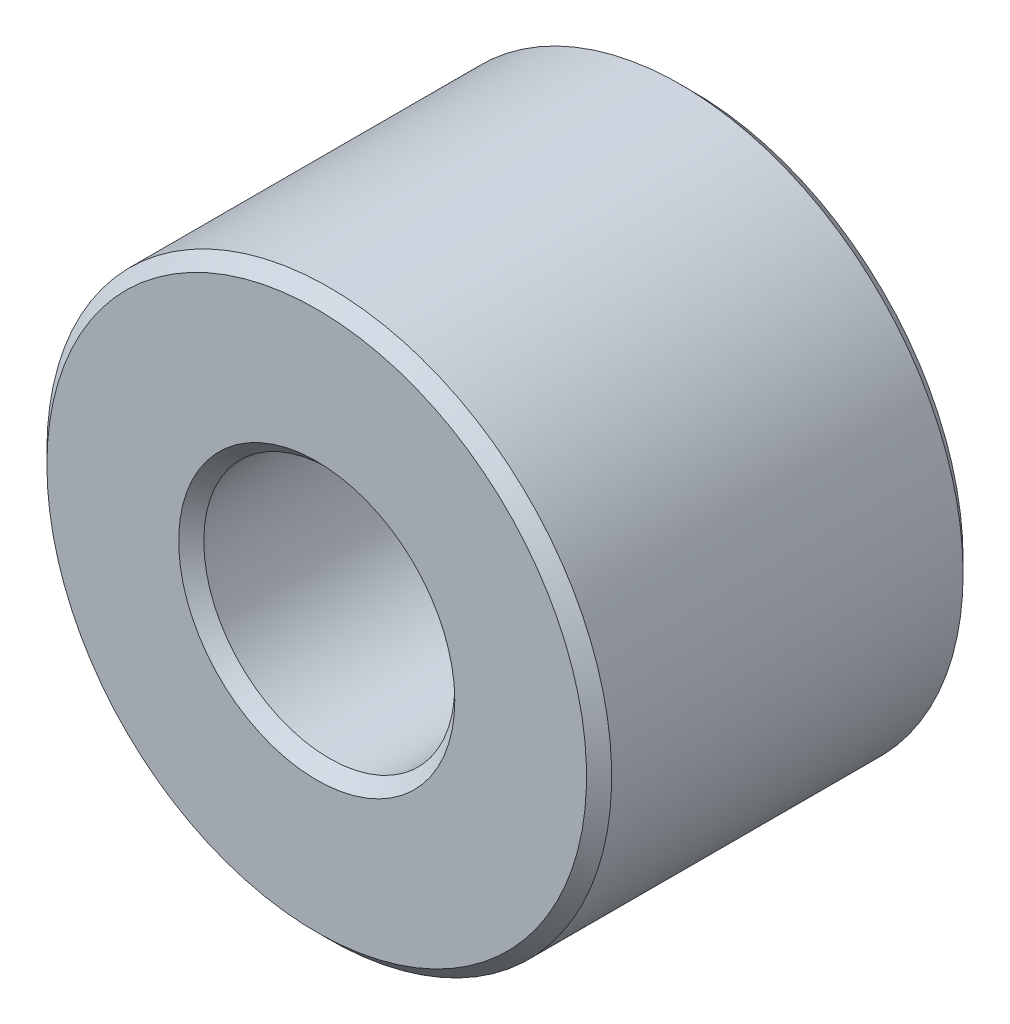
ISO-10303-21;
HEADER;
FILE_DESCRIPTION(('STEP AP214'),'2;1');
FILE_NAME('part.step','',(''),(''),'','','');
FILE_SCHEMA(('AUTOMOTIVE_DESIGN { 1 0 10303 214 1 1 1 1 }'));
ENDSEC;
DATA;
#1=APPLICATION_CONTEXT('core data for automotive mechanical design processes');
#2=APPLICATION_PROTOCOL_DEFINITION('international standard','automotive_design',2000,#1);
#3=PRODUCT_CONTEXT('',#1,'mechanical');
#4=PRODUCT('Part','Part','',(#3));
#5=PRODUCT_RELATED_PRODUCT_CATEGORY('part','',(#4));
#6=PRODUCT_DEFINITION_FORMATION('','',#4);
#7=PRODUCT_DEFINITION_CONTEXT('part definition',#1,'design');
#8=PRODUCT_DEFINITION('design','',#6,#7);
#9=PRODUCT_DEFINITION_SHAPE('','',#8);
#10=(LENGTH_UNIT() NAMED_UNIT(*) SI_UNIT(.MILLI.,.METRE.));
#11=(NAMED_UNIT(*) PLANE_ANGLE_UNIT() SI_UNIT($,.RADIAN.));
#12=(NAMED_UNIT(*) SI_UNIT($,.STERADIAN.) SOLID_ANGLE_UNIT());
#13=UNCERTAINTY_MEASURE_WITH_UNIT(LENGTH_MEASURE(1.E-05),#10,'distance_accuracy_value','');
#14=(GEOMETRIC_REPRESENTATION_CONTEXT(3) GLOBAL_UNCERTAINTY_ASSIGNED_CONTEXT((#13)) GLOBAL_UNIT_ASSIGNED_CONTEXT((#10,
#11,#12)) REPRESENTATION_CONTEXT('',''));
#15=CARTESIAN_POINT('',(0.,0.,0.));
#16=DIRECTION('',(0.,0.,1.));
#17=DIRECTION('',(1.,0.,0.));
#18=AXIS2_PLACEMENT_3D('',#15,#16,#17);
#19=CARTESIAN_POINT('',(0.,0.,12.));
#20=DIRECTION('',(0.,0.,1.));
#21=DIRECTION('',(1.,0.,0.));
#22=AXIS2_PLACEMENT_3D('',#19,#20,#21);
#23=PLANE('',#22);
#24=CARTESIAN_POINT('',(0.,0.,12.));
#25=DIRECTION('',(0.,0.,1.));
#26=DIRECTION('',(1.,0.,0.));
#27=AXIS2_PLACEMENT_3D('',#24,#25,#26);
#28=CIRCLE('',#27,8.80000000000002);
#29=CARTESIAN_POINT('',(8.80000000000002,0.,12.));
#30=VERTEX_POINT('',#29);
#31=EDGE_CURVE('E10',#30,#30,#28,.F.);
#32=ORIENTED_EDGE('',*,*,#31,.T.);
#33=EDGE_LOOP('',(#32));
#34=FACE_BOUND('',#33,.T.);
#35=CARTESIAN_POINT('',(0.,0.,12.));
#36=DIRECTION('',(0.,0.,1.));
#37=DIRECTION('',(1.,0.,0.));
#38=AXIS2_PLACEMENT_3D('',#35,#36,#37);
#39=CIRCLE('',#38,17.2);
#40=CARTESIAN_POINT('',(-17.2,0.,12.));
#41=VERTEX_POINT('',#40);
#42=EDGE_CURVE('E40',#41,#41,#39,.T.);
#43=ORIENTED_EDGE('',*,*,#42,.T.);
#44=EDGE_LOOP('',(#43));
#45=FACE_BOUND('',#44,.T.);
#46=ADVANCED_FACE('F33',(#34,#45),#23,.T.);
#47=CARTESIAN_POINT('',(0.,0.,-12.));
#48=DIRECTION('',(0.,0.,1.));
#49=DIRECTION('',(1.,0.,0.));
#50=AXIS2_PLACEMENT_3D('',#47,#48,#49);
#51=PLANE('',#50);
#52=CARTESIAN_POINT('',(0.,0.,-12.));
#53=DIRECTION('',(0.,0.,1.));
#54=DIRECTION('',(1.,0.,0.));
#55=AXIS2_PLACEMENT_3D('',#52,#53,#54);
#56=CIRCLE('',#55,8.79999999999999);
#57=CARTESIAN_POINT('',(8.79999999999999,0.,-12.));
#58=VERTEX_POINT('',#57);
#59=EDGE_CURVE('E59',#58,#58,#56,.T.);
#60=ORIENTED_EDGE('',*,*,#59,.T.);
#61=EDGE_LOOP('',(#60));
#62=FACE_BOUND('',#61,.T.);
#63=CARTESIAN_POINT('',(0.,0.,-12.));
#64=DIRECTION('',(0.,0.,1.));
#65=DIRECTION('',(1.,0.,0.));
#66=AXIS2_PLACEMENT_3D('',#63,#64,#65);
#67=CIRCLE('',#66,17.2);
#68=CARTESIAN_POINT('',(17.2,0.,-12.));
#69=VERTEX_POINT('',#68);
#70=EDGE_CURVE('E62',#69,#69,#67,.F.);
#71=ORIENTED_EDGE('',*,*,#70,.T.);
#72=EDGE_LOOP('',(#71));
#73=FACE_BOUND('',#72,.T.);
#74=ADVANCED_FACE('F66',(#62,#73),#51,.F.);
#75=CARTESIAN_POINT('',(0.,0.,12.));
#76=DIRECTION('',(0.,0.,-1.));
#77=DIRECTION('',(-1.,0.,0.));
#78=AXIS2_PLACEMENT_3D('',#75,#76,#77);
#79=CYLINDRICAL_SURFACE('',#78,18.);
#80=CARTESIAN_POINT('',(0.,0.,-11.2));
#81=DIRECTION('',(0.,0.,1.));
#82=DIRECTION('',(1.,0.,0.));
#83=AXIS2_PLACEMENT_3D('',#80,#81,#82);
#84=CIRCLE('',#83,18.);
#85=CARTESIAN_POINT('',(18.,0.,-11.2));
#86=VERTEX_POINT('',#85);
#87=EDGE_CURVE('E44',#86,#86,#84,.T.);
#88=ORIENTED_EDGE('',*,*,#87,.T.);
#89=EDGE_LOOP('',(#88));
#90=FACE_BOUND('',#89,.T.);
#91=CARTESIAN_POINT('',(0.,0.,11.2));
#92=DIRECTION('',(0.,0.,1.));
#93=DIRECTION('',(1.,0.,0.));
#94=AXIS2_PLACEMENT_3D('',#91,#92,#93);
#95=CIRCLE('',#94,18.);
#96=CARTESIAN_POINT('',(-18.,0.,11.2));
#97=VERTEX_POINT('',#96);
#98=EDGE_CURVE('E48',#97,#97,#95,.F.);
#99=ORIENTED_EDGE('',*,*,#98,.T.);
#100=EDGE_LOOP('',(#99));
#101=FACE_BOUND('',#100,.T.);
#102=ADVANCED_FACE('F76',(#90,#101),#79,.T.);
#103=CARTESIAN_POINT('',(0.,0.,12.));
#104=DIRECTION('',(0.,0.,-1.));
#105=DIRECTION('',(-1.,0.,0.));
#106=AXIS2_PLACEMENT_3D('',#103,#104,#105);
#107=CYLINDRICAL_SURFACE('',#106,8.);
#108=CARTESIAN_POINT('',(0.,0.,-11.2));
#109=DIRECTION('',(0.,0.,1.));
#110=DIRECTION('',(1.,0.,0.));
#111=AXIS2_PLACEMENT_3D('',#108,#109,#110);
#112=CIRCLE('',#111,8.);
#113=CARTESIAN_POINT('',(8.,0.,-11.2));
#114=VERTEX_POINT('',#113);
#115=EDGE_CURVE('E53',#114,#114,#112,.F.);
#116=ORIENTED_EDGE('',*,*,#115,.T.);
#117=EDGE_LOOP('',(#116));
#118=FACE_BOUND('',#117,.T.);
#119=CARTESIAN_POINT('',(0.,0.,11.2));
#120=DIRECTION('',(0.,0.,1.));
#121=DIRECTION('',(1.,0.,0.));
#122=AXIS2_PLACEMENT_3D('',#119,#120,#121);
#123=CIRCLE('',#122,8.);
#124=CARTESIAN_POINT('',(8.,0.,11.2));
#125=VERTEX_POINT('',#124);
#126=EDGE_CURVE('E56',#125,#125,#123,.T.);
#127=ORIENTED_EDGE('',*,*,#126,.T.);
#128=EDGE_LOOP('',(#127));
#129=FACE_BOUND('',#128,.T.);
#130=ADVANCED_FACE('F79',(#118,#129),#107,.F.);
#131=CARTESIAN_POINT('',(0.,0.,-12.));
#132=DIRECTION('',(0.,0.,-1.));
#133=DIRECTION('',(-1.,0.,0.));
#134=AXIS2_PLACEMENT_3D('',#131,#132,#133);
#135=CONICAL_SURFACE('',#134,8.79999999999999,0.785398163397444);
#136=ORIENTED_EDGE('',*,*,#115,.F.);
#137=EDGE_LOOP('',(#136));
#138=FACE_BOUND('',#137,.T.);
#139=ORIENTED_EDGE('',*,*,#59,.F.);
#140=EDGE_LOOP('',(#139));
#141=FACE_BOUND('',#140,.T.);
#142=ADVANCED_FACE('F72',(#138,#141),#135,.F.);
#143=CARTESIAN_POINT('',(0.,0.,-11.2));
#144=DIRECTION('',(0.,0.,1.));
#145=DIRECTION('',(1.,0.,0.));
#146=AXIS2_PLACEMENT_3D('',#143,#144,#145);
#147=CONICAL_SURFACE('',#146,18.,0.78539816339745);
#148=ORIENTED_EDGE('',*,*,#70,.F.);
#149=EDGE_LOOP('',(#148));
#150=FACE_BOUND('',#149,.T.);
#151=ORIENTED_EDGE('',*,*,#87,.F.);
#152=EDGE_LOOP('',(#151));
#153=FACE_BOUND('',#152,.T.);
#154=ADVANCED_FACE('F68',(#150,#153),#147,.T.);
#155=CARTESIAN_POINT('',(0.,0.,11.2));
#156=DIRECTION('',(0.,0.,1.));
#157=DIRECTION('',(1.,0.,0.));
#158=AXIS2_PLACEMENT_3D('',#155,#156,#157);
#159=CONICAL_SURFACE('',#158,8.,0.785398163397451);
#160=ORIENTED_EDGE('',*,*,#31,.F.);
#161=EDGE_LOOP('',(#160));
#162=FACE_BOUND('',#161,.T.);
#163=ORIENTED_EDGE('',*,*,#126,.F.);
#164=EDGE_LOOP('',(#163));
#165=FACE_BOUND('',#164,.T.);
#166=ADVANCED_FACE('F71',(#162,#165),#159,.F.);
#167=CARTESIAN_POINT('',(0.,0.,12.));
#168=DIRECTION('',(0.,0.,-1.));
#169=DIRECTION('',(-1.,0.,0.));
#170=AXIS2_PLACEMENT_3D('',#167,#168,#169);
#171=CONICAL_SURFACE('',#170,17.2,0.78539816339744);
#172=CARTESIAN_POINT('',(-18.,0.,11.2));
#173=CARTESIAN_POINT('',(-17.9916666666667,0.,11.2083333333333));
#174=CARTESIAN_POINT('',(-17.9833333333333,0.,11.2166666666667));
#175=CARTESIAN_POINT('',(-17.9666666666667,0.,11.2333333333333));
#176=CARTESIAN_POINT('',(-17.9583333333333,0.,11.2416666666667));
#177=CARTESIAN_POINT('',(-17.9416666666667,0.,11.2583333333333));
#178=CARTESIAN_POINT('',(-17.9333333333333,0.,11.2666666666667));
#179=CARTESIAN_POINT('',(-17.9166666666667,0.,11.2833333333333));
#180=CARTESIAN_POINT('',(-17.9083333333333,0.,11.2916666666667));
#181=CARTESIAN_POINT('',(-17.8916666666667,0.,11.3083333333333));
#182=CARTESIAN_POINT('',(-17.8833333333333,0.,11.3166666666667));
#183=CARTESIAN_POINT('',(-17.8666666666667,0.,11.3333333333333));
#184=CARTESIAN_POINT('',(-17.8583333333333,0.,11.3416666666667));
#185=CARTESIAN_POINT('',(-17.8416666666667,0.,11.3583333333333));
#186=CARTESIAN_POINT('',(-17.8333333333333,0.,11.3666666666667));
#187=CARTESIAN_POINT('',(-17.8166666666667,0.,11.3833333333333));
#188=CARTESIAN_POINT('',(-17.8083333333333,0.,11.3916666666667));
#189=CARTESIAN_POINT('',(-17.7916666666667,0.,11.4083333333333));
#190=CARTESIAN_POINT('',(-17.7833333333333,0.,11.4166666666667));
#191=CARTESIAN_POINT('',(-17.7666666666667,0.,11.4333333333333));
#192=CARTESIAN_POINT('',(-17.7583333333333,0.,11.4416666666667));
#193=CARTESIAN_POINT('',(-17.7416666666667,0.,11.4583333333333));
#194=CARTESIAN_POINT('',(-17.7333333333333,0.,11.4666666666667));
#195=CARTESIAN_POINT('',(-17.7166666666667,0.,11.4833333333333));
#196=CARTESIAN_POINT('',(-17.7083333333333,0.,11.4916666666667));
#197=CARTESIAN_POINT('',(-17.6916666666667,0.,11.5083333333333));
#198=CARTESIAN_POINT('',(-17.6833333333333,0.,11.5166666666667));
#199=CARTESIAN_POINT('',(-17.6666666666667,0.,11.5333333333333));
#200=CARTESIAN_POINT('',(-17.6583333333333,0.,11.5416666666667));
#201=CARTESIAN_POINT('',(-17.6416666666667,0.,11.5583333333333));
#202=CARTESIAN_POINT('',(-17.6333333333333,0.,11.5666666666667));
#203=CARTESIAN_POINT('',(-17.6166666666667,0.,11.5833333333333));
#204=CARTESIAN_POINT('',(-17.6083333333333,0.,11.5916666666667));
#205=CARTESIAN_POINT('',(-17.5916666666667,0.,11.6083333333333));
#206=CARTESIAN_POINT('',(-17.5833333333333,0.,11.6166666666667));
#207=CARTESIAN_POINT('',(-17.5666666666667,0.,11.6333333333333));
#208=CARTESIAN_POINT('',(-17.5583333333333,0.,11.6416666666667));
#209=CARTESIAN_POINT('',(-17.5416666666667,0.,11.6583333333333));
#210=CARTESIAN_POINT('',(-17.5333333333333,0.,11.6666666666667));
#211=CARTESIAN_POINT('',(-17.5166666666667,0.,11.6833333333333));
#212=CARTESIAN_POINT('',(-17.5083333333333,0.,11.6916666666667));
#213=CARTESIAN_POINT('',(-17.4916666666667,0.,11.7083333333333));
#214=CARTESIAN_POINT('',(-17.4833333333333,0.,11.7166666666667));
#215=CARTESIAN_POINT('',(-17.4666666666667,0.,11.7333333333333));
#216=CARTESIAN_POINT('',(-17.4583333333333,0.,11.7416666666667));
#217=CARTESIAN_POINT('',(-17.4416666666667,0.,11.7583333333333));
#218=CARTESIAN_POINT('',(-17.4333333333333,0.,11.7666666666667));
#219=CARTESIAN_POINT('',(-17.4166666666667,0.,11.7833333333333));
#220=CARTESIAN_POINT('',(-17.4083333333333,0.,11.7916666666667));
#221=CARTESIAN_POINT('',(-17.3916666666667,0.,11.8083333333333));
#222=CARTESIAN_POINT('',(-17.3833333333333,0.,11.8166666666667));
#223=CARTESIAN_POINT('',(-17.3666666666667,0.,11.8333333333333));
#224=CARTESIAN_POINT('',(-17.3583333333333,0.,11.8416666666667));
#225=CARTESIAN_POINT('',(-17.3416666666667,0.,11.8583333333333));
#226=CARTESIAN_POINT('',(-17.3333333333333,0.,11.8666666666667));
#227=CARTESIAN_POINT('',(-17.3166666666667,0.,11.8833333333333));
#228=CARTESIAN_POINT('',(-17.3083333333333,0.,11.8916666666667));
#229=CARTESIAN_POINT('',(-17.2916666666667,0.,11.9083333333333));
#230=CARTESIAN_POINT('',(-17.2833333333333,0.,11.9166666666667));
#231=CARTESIAN_POINT('',(-17.2666666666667,0.,11.9333333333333));
#232=CARTESIAN_POINT('',(-17.2583333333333,0.,11.9416666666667));
#233=CARTESIAN_POINT('',(-17.2416666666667,0.,11.9583333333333));
#234=CARTESIAN_POINT('',(-17.2333333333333,0.,11.9666666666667));
#235=CARTESIAN_POINT('',(-17.2166666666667,0.,11.9833333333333));
#236=CARTESIAN_POINT('',(-17.2083333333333,0.,11.9916666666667));
#237=CARTESIAN_POINT('',(-17.2,0.,12.));
#238=B_SPLINE_CURVE_WITH_KNOTS('',3,(#172,#173,#174,#175,#176,#177,#178,#179,#180,#181,#182,
#183,#184,#185,#186,#187,#188,#189,#190,#191,#192,#193,#194,#195,#196,#197,#198,#199,#200,#201,
#202,#203,#204,#205,#206,#207,#208,#209,#210,#211,#212,#213,#214,#215,#216,#217,#218,#219,#220,
#221,#222,#223,#224,#225,#226,#227,#228,#229,#230,#231,#232,#233,#234,#235,#236,#237),
.UNSPECIFIED.,.F.,.F.,(4,2,2,2,2,2,2,2,2,2,2,2,2,2,2,2,2,2,2,2,2,2,2,2,2,2,2,2,2,2,2,2,4),(0.,
0.0353553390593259,0.0707106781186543,0.106066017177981,0.141421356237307,0.176776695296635,
0.212132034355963,0.247487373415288,0.282842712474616,0.318198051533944,0.353553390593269,
0.388908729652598,0.424264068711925,0.459619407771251,0.494974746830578,0.530330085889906,
0.565685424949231,0.601040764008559,0.636396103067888,0.671751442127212,0.707106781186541,
0.742462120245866,0.777817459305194,0.813172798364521,0.848528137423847,0.883883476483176,
0.919238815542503,0.954594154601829,0.989949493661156,1.02530483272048,1.06066017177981,
1.09601551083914,1.13137084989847),.UNSPECIFIED.);
#239=EDGE_CURVE('BSEAM35',#97,#41,#238,.T.);
#240=ORIENTED_EDGE('',*,*,#98,.F.);
#241=ORIENTED_EDGE('',*,*,#42,.F.);
#242=ORIENTED_EDGE('',*,*,#239,.T.);
#243=ORIENTED_EDGE('',*,*,#239,.F.);
#244=EDGE_LOOP('',(#240,#242,#241,#243));
#245=FACE_BOUND('',#244,.T.);
#246=ADVANCED_FACE('F35',(#245),#171,.T.);
#247=CLOSED_SHELL('',(#46,#74,#102,#130,#142,#154,#166,#246));
#248=MANIFOLD_SOLID_BREP('B2',#247);
#249=ADVANCED_BREP_SHAPE_REPRESENTATION('',(#18,#248),#14);
#250=SHAPE_DEFINITION_REPRESENTATION(#9,#249);
ENDSEC;
END-ISO-10303-21;
